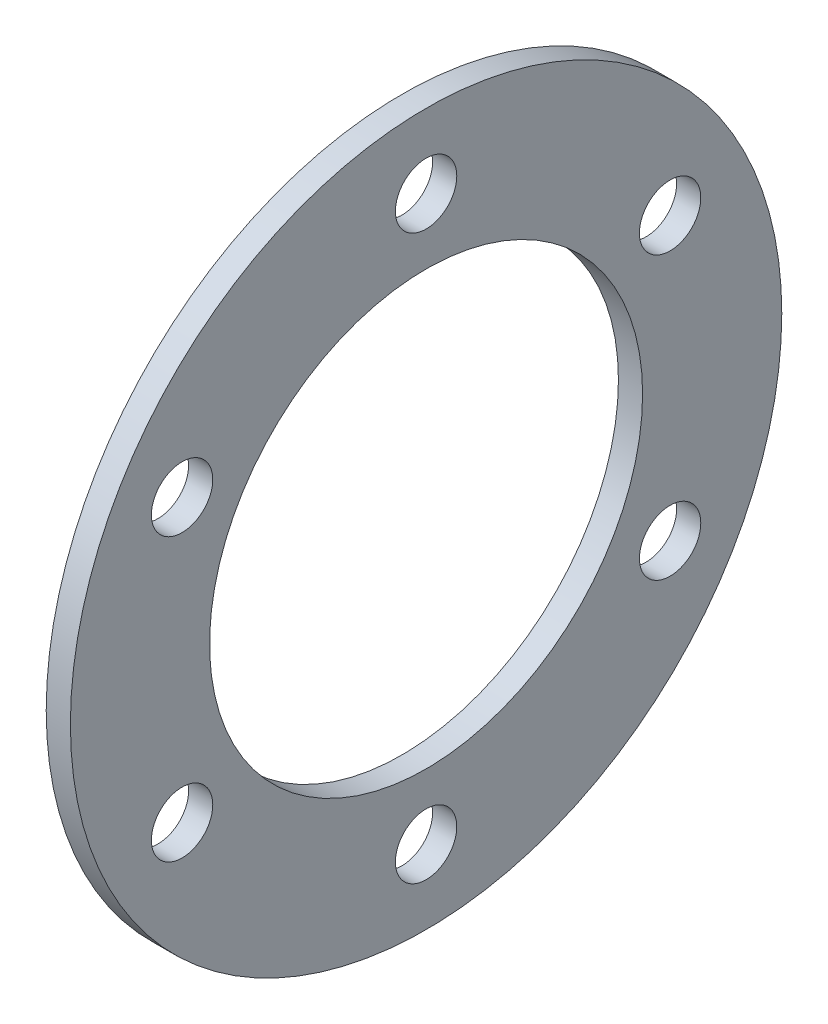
ISO-10303-21;
HEADER;
FILE_DESCRIPTION(('STEP AP214'),'2;1');
FILE_NAME('part.step','',(''),(''),'','','');
FILE_SCHEMA(('AUTOMOTIVE_DESIGN { 1 0 10303 214 1 1 1 1 }'));
ENDSEC;
DATA;
#1=APPLICATION_CONTEXT('core data for automotive mechanical design processes');
#2=APPLICATION_PROTOCOL_DEFINITION('international standard','automotive_design',2000,#1);
#3=PRODUCT_CONTEXT('',#1,'mechanical');
#4=PRODUCT('Part','Part','',(#3));
#5=PRODUCT_RELATED_PRODUCT_CATEGORY('part','',(#4));
#6=PRODUCT_DEFINITION_FORMATION('','',#4);
#7=PRODUCT_DEFINITION_CONTEXT('part definition',#1,'design');
#8=PRODUCT_DEFINITION('design','',#6,#7);
#9=PRODUCT_DEFINITION_SHAPE('','',#8);
#10=(LENGTH_UNIT() NAMED_UNIT(*) SI_UNIT(.MILLI.,.METRE.));
#11=(NAMED_UNIT(*) PLANE_ANGLE_UNIT() SI_UNIT($,.RADIAN.));
#12=(NAMED_UNIT(*) SI_UNIT($,.STERADIAN.) SOLID_ANGLE_UNIT());
#13=UNCERTAINTY_MEASURE_WITH_UNIT(LENGTH_MEASURE(1.E-05),#10,'distance_accuracy_value','');
#14=(GEOMETRIC_REPRESENTATION_CONTEXT(3) GLOBAL_UNCERTAINTY_ASSIGNED_CONTEXT((#13)) GLOBAL_UNIT_ASSIGNED_CONTEXT((#10,
#11,#12)) REPRESENTATION_CONTEXT('',''));
#15=CARTESIAN_POINT('',(0.,0.,0.));
#16=DIRECTION('',(0.,0.,1.));
#17=DIRECTION('',(1.,0.,0.));
#18=AXIS2_PLACEMENT_3D('',#15,#16,#17);
#19=CARTESIAN_POINT('',(3.125,0.,0.));
#20=DIRECTION('',(1.,0.,0.));
#21=DIRECTION('',(0.,0.,-1.));
#22=AXIS2_PLACEMENT_3D('',#19,#20,#21);
#23=PLANE('',#22);
#24=CARTESIAN_POINT('',(3.125,18.2176562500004,31.5539062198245));
#25=DIRECTION('',(1.,0.,0.));
#26=DIRECTION('',(0.,0.866025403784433,-0.50000000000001));
#27=AXIS2_PLACEMENT_3D('',#24,#25,#26);
#28=CIRCLE('',#27,3.96874999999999);
#29=CARTESIAN_POINT('',(3.125,21.6546945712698,29.5695312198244));
#30=VERTEX_POINT('',#29);
#31=EDGE_CURVE('E82',#30,#30,#28,.T.);
#32=ORIENTED_EDGE('',*,*,#31,.F.);
#33=EDGE_LOOP('',(#32));
#34=FACE_BOUND('',#33,.T.);
#35=CARTESIAN_POINT('',(3.125,-18.2176562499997,31.5539062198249));
#36=DIRECTION('',(1.,0.,0.));
#37=DIRECTION('',(0.,0.866025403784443,0.499999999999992));
#38=AXIS2_PLACEMENT_3D('',#35,#36,#37);
#39=CIRCLE('',#38,3.96874999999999);
#40=CARTESIAN_POINT('',(3.125,-14.7806179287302,33.5382812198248));
#41=VERTEX_POINT('',#40);
#42=EDGE_CURVE('E76',#41,#41,#39,.T.);
#43=ORIENTED_EDGE('',*,*,#42,.F.);
#44=EDGE_LOOP('',(#43));
#45=FACE_BOUND('',#44,.T.);
#46=CARTESIAN_POINT('',(3.125,-36.4353125,0.));
#47=DIRECTION('',(1.,0.,0.));
#48=DIRECTION('',(0.,0.,1.));
#49=AXIS2_PLACEMENT_3D('',#46,#47,#48);
#50=CIRCLE('',#49,3.96874999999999);
#51=CARTESIAN_POINT('',(3.125,-36.4353125,3.96874999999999));
#52=VERTEX_POINT('',#51);
#53=EDGE_CURVE('E70',#52,#52,#50,.T.);
#54=ORIENTED_EDGE('',*,*,#53,.F.);
#55=EDGE_LOOP('',(#54));
#56=FACE_BOUND('',#55,.T.);
#57=CARTESIAN_POINT('',(3.125,-18.2176562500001,-31.5539062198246));
#58=DIRECTION('',(1.,0.,0.));
#59=DIRECTION('',(0.,-0.866025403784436,0.500000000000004));
#60=AXIS2_PLACEMENT_3D('',#57,#58,#59);
#61=CIRCLE('',#60,3.96874999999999);
#62=CARTESIAN_POINT('',(3.125,-21.6546945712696,-29.5695312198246));
#63=VERTEX_POINT('',#62);
#64=EDGE_CURVE('E64',#63,#63,#61,.T.);
#65=ORIENTED_EDGE('',*,*,#64,.F.);
#66=EDGE_LOOP('',(#65));
#67=FACE_BOUND('',#66,.T.);
#68=CARTESIAN_POINT('',(3.125,18.2176562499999,-31.5539062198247));
#69=DIRECTION('',(1.,0.,0.));
#70=DIRECTION('',(0.,-0.86602540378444,-0.499999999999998));
#71=AXIS2_PLACEMENT_3D('',#68,#69,#70);
#72=CIRCLE('',#71,3.96874999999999);
#73=CARTESIAN_POINT('',(3.125,14.7806179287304,-33.5382812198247));
#74=VERTEX_POINT('',#73);
#75=EDGE_CURVE('E58',#74,#74,#72,.T.);
#76=ORIENTED_EDGE('',*,*,#75,.F.);
#77=EDGE_LOOP('',(#76));
#78=FACE_BOUND('',#77,.T.);
#79=CARTESIAN_POINT('',(3.125,36.4353125,0.));
#80=DIRECTION('',(1.,0.,0.));
#81=DIRECTION('',(0.,0.,-1.));
#82=AXIS2_PLACEMENT_3D('',#79,#80,#81);
#83=CIRCLE('',#82,3.96874999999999);
#84=CARTESIAN_POINT('',(3.125,36.4353125,-3.96874999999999));
#85=VERTEX_POINT('',#84);
#86=EDGE_CURVE('E52',#85,#85,#83,.T.);
#87=ORIENTED_EDGE('',*,*,#86,.F.);
#88=EDGE_LOOP('',(#87));
#89=FACE_BOUND('',#88,.T.);
#90=CARTESIAN_POINT('',(3.125,0.,0.));
#91=DIRECTION('',(1.,0.,0.));
#92=DIRECTION('',(0.,0.,-1.));
#93=AXIS2_PLACEMENT_3D('',#90,#91,#92);
#94=CIRCLE('',#93,46.);
#95=CARTESIAN_POINT('',(3.125,0.,-46.));
#96=VERTEX_POINT('',#95);
#97=EDGE_CURVE('E10',#96,#96,#94,.T.);
#98=ORIENTED_EDGE('',*,*,#97,.T.);
#99=EDGE_LOOP('',(#98));
#100=FACE_BOUND('',#99,.T.);
#101=CARTESIAN_POINT('',(3.125,0.,0.));
#102=DIRECTION('',(1.,0.,0.));
#103=DIRECTION('',(0.,0.,-1.));
#104=AXIS2_PLACEMENT_3D('',#101,#102,#103);
#105=CIRCLE('',#104,28.);
#106=CARTESIAN_POINT('',(3.125,0.,-28.));
#107=VERTEX_POINT('',#106);
#108=EDGE_CURVE('E44',#107,#107,#105,.T.);
#109=ORIENTED_EDGE('',*,*,#108,.F.);
#110=EDGE_LOOP('',(#109));
#111=FACE_BOUND('',#110,.T.);
#112=ADVANCED_FACE('F33',(#34,#45,#56,#67,#78,#89,#100,#111),#23,.T.);
#113=CARTESIAN_POINT('',(0.,0.,0.));
#114=DIRECTION('',(1.,0.,0.));
#115=DIRECTION('',(0.,0.,-1.));
#116=AXIS2_PLACEMENT_3D('',#113,#114,#115);
#117=PLANE('',#116);
#118=CARTESIAN_POINT('',(0.,18.2176562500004,31.5539062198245));
#119=DIRECTION('',(1.,0.,0.));
#120=DIRECTION('',(0.,0.866025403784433,-0.50000000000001));
#121=AXIS2_PLACEMENT_3D('',#118,#119,#120);
#122=CIRCLE('',#121,3.96874999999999);
#123=CARTESIAN_POINT('',(0.,21.6546945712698,29.5695312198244));
#124=VERTEX_POINT('',#123);
#125=EDGE_CURVE('E79',#124,#124,#122,.T.);
#126=ORIENTED_EDGE('',*,*,#125,.T.);
#127=EDGE_LOOP('',(#126));
#128=FACE_BOUND('',#127,.T.);
#129=CARTESIAN_POINT('',(0.,-18.2176562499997,31.5539062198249));
#130=DIRECTION('',(1.,0.,0.));
#131=DIRECTION('',(0.,0.866025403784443,0.499999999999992));
#132=AXIS2_PLACEMENT_3D('',#129,#130,#131);
#133=CIRCLE('',#132,3.96874999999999);
#134=CARTESIAN_POINT('',(0.,-14.7806179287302,33.5382812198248));
#135=VERTEX_POINT('',#134);
#136=EDGE_CURVE('E73',#135,#135,#133,.T.);
#137=ORIENTED_EDGE('',*,*,#136,.T.);
#138=EDGE_LOOP('',(#137));
#139=FACE_BOUND('',#138,.T.);
#140=CARTESIAN_POINT('',(0.,-36.4353125,0.));
#141=DIRECTION('',(1.,0.,0.));
#142=DIRECTION('',(0.,0.,1.));
#143=AXIS2_PLACEMENT_3D('',#140,#141,#142);
#144=CIRCLE('',#143,3.96874999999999);
#145=CARTESIAN_POINT('',(0.,-36.4353125,3.96874999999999));
#146=VERTEX_POINT('',#145);
#147=EDGE_CURVE('E67',#146,#146,#144,.T.);
#148=ORIENTED_EDGE('',*,*,#147,.T.);
#149=EDGE_LOOP('',(#148));
#150=FACE_BOUND('',#149,.T.);
#151=CARTESIAN_POINT('',(0.,-18.2176562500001,-31.5539062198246));
#152=DIRECTION('',(1.,0.,0.));
#153=DIRECTION('',(0.,-0.866025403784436,0.500000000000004));
#154=AXIS2_PLACEMENT_3D('',#151,#152,#153);
#155=CIRCLE('',#154,3.96874999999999);
#156=CARTESIAN_POINT('',(0.,-21.6546945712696,-29.5695312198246));
#157=VERTEX_POINT('',#156);
#158=EDGE_CURVE('E61',#157,#157,#155,.T.);
#159=ORIENTED_EDGE('',*,*,#158,.T.);
#160=EDGE_LOOP('',(#159));
#161=FACE_BOUND('',#160,.T.);
#162=CARTESIAN_POINT('',(0.,18.2176562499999,-31.5539062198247));
#163=DIRECTION('',(1.,0.,0.));
#164=DIRECTION('',(0.,-0.86602540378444,-0.499999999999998));
#165=AXIS2_PLACEMENT_3D('',#162,#163,#164);
#166=CIRCLE('',#165,3.96874999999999);
#167=CARTESIAN_POINT('',(0.,14.7806179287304,-33.5382812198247));
#168=VERTEX_POINT('',#167);
#169=EDGE_CURVE('E55',#168,#168,#166,.T.);
#170=ORIENTED_EDGE('',*,*,#169,.T.);
#171=EDGE_LOOP('',(#170));
#172=FACE_BOUND('',#171,.T.);
#173=CARTESIAN_POINT('',(0.,36.4353125,0.));
#174=DIRECTION('',(1.,0.,0.));
#175=DIRECTION('',(0.,0.,-1.));
#176=AXIS2_PLACEMENT_3D('',#173,#174,#175);
#177=CIRCLE('',#176,3.96874999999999);
#178=CARTESIAN_POINT('',(0.,36.4353125,-3.96874999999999));
#179=VERTEX_POINT('',#178);
#180=EDGE_CURVE('E49',#179,#179,#177,.T.);
#181=ORIENTED_EDGE('',*,*,#180,.T.);
#182=EDGE_LOOP('',(#181));
#183=FACE_BOUND('',#182,.T.);
#184=CARTESIAN_POINT('',(0.,0.,0.));
#185=DIRECTION('',(1.,0.,0.));
#186=DIRECTION('',(0.,0.,-1.));
#187=AXIS2_PLACEMENT_3D('',#184,#185,#186);
#188=CIRCLE('',#187,46.);
#189=CARTESIAN_POINT('',(0.,0.,-46.));
#190=VERTEX_POINT('',#189);
#191=EDGE_CURVE('E37',#190,#190,#188,.T.);
#192=ORIENTED_EDGE('',*,*,#191,.F.);
#193=EDGE_LOOP('',(#192));
#194=FACE_BOUND('',#193,.T.);
#195=CARTESIAN_POINT('',(0.,0.,0.));
#196=DIRECTION('',(1.,0.,0.));
#197=DIRECTION('',(0.,0.,-1.));
#198=AXIS2_PLACEMENT_3D('',#195,#196,#197);
#199=CIRCLE('',#198,28.);
#200=CARTESIAN_POINT('',(0.,0.,-28.));
#201=VERTEX_POINT('',#200);
#202=EDGE_CURVE('E46',#201,#201,#199,.T.);
#203=ORIENTED_EDGE('',*,*,#202,.T.);
#204=EDGE_LOOP('',(#203));
#205=FACE_BOUND('',#204,.T.);
#206=ADVANCED_FACE('F88',(#128,#139,#150,#161,#172,#183,#194,#205),#117,.F.);
#207=CARTESIAN_POINT('',(3.125,0.,0.));
#208=DIRECTION('',(-1.,0.,0.));
#209=DIRECTION('',(0.,0.,1.));
#210=AXIS2_PLACEMENT_3D('',#207,#208,#209);
#211=CYLINDRICAL_SURFACE('',#210,46.);
#212=ORIENTED_EDGE('',*,*,#97,.F.);
#213=EDGE_LOOP('',(#212));
#214=FACE_BOUND('',#213,.T.);
#215=ORIENTED_EDGE('',*,*,#191,.T.);
#216=EDGE_LOOP('',(#215));
#217=FACE_BOUND('',#216,.T.);
#218=ADVANCED_FACE('F35',(#214,#217),#211,.T.);
#219=CARTESIAN_POINT('',(3.125,0.,0.));
#220=DIRECTION('',(-1.,0.,0.));
#221=DIRECTION('',(0.,0.,1.));
#222=AXIS2_PLACEMENT_3D('',#219,#220,#221);
#223=CYLINDRICAL_SURFACE('',#222,28.);
#224=ORIENTED_EDGE('',*,*,#108,.T.);
#225=EDGE_LOOP('',(#224));
#226=FACE_BOUND('',#225,.T.);
#227=ORIENTED_EDGE('',*,*,#202,.F.);
#228=EDGE_LOOP('',(#227));
#229=FACE_BOUND('',#228,.T.);
#230=ADVANCED_FACE('F113',(#226,#229),#223,.F.);
#231=CARTESIAN_POINT('',(0.,36.4353125,0.));
#232=DIRECTION('',(1.,0.,0.));
#233=DIRECTION('',(0.,0.,-1.));
#234=AXIS2_PLACEMENT_3D('',#231,#232,#233);
#235=CYLINDRICAL_SURFACE('',#234,3.96874999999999);
#236=ORIENTED_EDGE('',*,*,#180,.F.);
#237=EDGE_LOOP('',(#236));
#238=FACE_BOUND('',#237,.T.);
#239=ORIENTED_EDGE('',*,*,#86,.T.);
#240=EDGE_LOOP('',(#239));
#241=FACE_BOUND('',#240,.T.);
#242=ADVANCED_FACE('F116',(#238,#241),#235,.F.);
#243=CARTESIAN_POINT('',(0.,18.2176562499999,-31.5539062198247));
#244=DIRECTION('',(1.,0.,0.));
#245=DIRECTION('',(0.,0.,-1.));
#246=AXIS2_PLACEMENT_3D('',#243,#244,#245);
#247=CYLINDRICAL_SURFACE('',#246,3.96874999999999);
#248=ORIENTED_EDGE('',*,*,#169,.F.);
#249=EDGE_LOOP('',(#248));
#250=FACE_BOUND('',#249,.T.);
#251=ORIENTED_EDGE('',*,*,#75,.T.);
#252=EDGE_LOOP('',(#251));
#253=FACE_BOUND('',#252,.T.);
#254=ADVANCED_FACE('F128',(#250,#253),#247,.F.);
#255=CARTESIAN_POINT('',(0.,-18.2176562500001,-31.5539062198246));
#256=DIRECTION('',(1.,0.,0.));
#257=DIRECTION('',(0.,0.,-1.));
#258=AXIS2_PLACEMENT_3D('',#255,#256,#257);
#259=CYLINDRICAL_SURFACE('',#258,3.96874999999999);
#260=ORIENTED_EDGE('',*,*,#158,.F.);
#261=EDGE_LOOP('',(#260));
#262=FACE_BOUND('',#261,.T.);
#263=ORIENTED_EDGE('',*,*,#64,.T.);
#264=EDGE_LOOP('',(#263));
#265=FACE_BOUND('',#264,.T.);
#266=ADVANCED_FACE('F132',(#262,#265),#259,.F.);
#267=CARTESIAN_POINT('',(0.,-36.4353125,0.));
#268=DIRECTION('',(1.,0.,0.));
#269=DIRECTION('',(0.,0.,-1.));
#270=AXIS2_PLACEMENT_3D('',#267,#268,#269);
#271=CYLINDRICAL_SURFACE('',#270,3.96874999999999);
#272=ORIENTED_EDGE('',*,*,#147,.F.);
#273=EDGE_LOOP('',(#272));
#274=FACE_BOUND('',#273,.T.);
#275=ORIENTED_EDGE('',*,*,#53,.T.);
#276=EDGE_LOOP('',(#275));
#277=FACE_BOUND('',#276,.T.);
#278=ADVANCED_FACE('F136',(#274,#277),#271,.F.);
#279=CARTESIAN_POINT('',(0.,-18.2176562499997,31.5539062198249));
#280=DIRECTION('',(1.,0.,0.));
#281=DIRECTION('',(0.,0.,-1.));
#282=AXIS2_PLACEMENT_3D('',#279,#280,#281);
#283=CYLINDRICAL_SURFACE('',#282,3.96874999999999);
#284=ORIENTED_EDGE('',*,*,#136,.F.);
#285=EDGE_LOOP('',(#284));
#286=FACE_BOUND('',#285,.T.);
#287=ORIENTED_EDGE('',*,*,#42,.T.);
#288=EDGE_LOOP('',(#287));
#289=FACE_BOUND('',#288,.T.);
#290=ADVANCED_FACE('F94',(#286,#289),#283,.F.);
#291=CARTESIAN_POINT('',(0.,18.2176562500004,31.5539062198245));
#292=DIRECTION('',(1.,0.,0.));
#293=DIRECTION('',(0.,0.,-1.));
#294=AXIS2_PLACEMENT_3D('',#291,#292,#293);
#295=CYLINDRICAL_SURFACE('',#294,3.96874999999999);
#296=ORIENTED_EDGE('',*,*,#125,.F.);
#297=EDGE_LOOP('',(#296));
#298=FACE_BOUND('',#297,.T.);
#299=ORIENTED_EDGE('',*,*,#31,.T.);
#300=EDGE_LOOP('',(#299));
#301=FACE_BOUND('',#300,.T.);
#302=ADVANCED_FACE('F91',(#298,#301),#295,.F.);
#303=CLOSED_SHELL('',(#112,#206,#218,#230,#242,#254,#266,#278,#290,#302));
#304=MANIFOLD_SOLID_BREP('B2',#303);
#305=ADVANCED_BREP_SHAPE_REPRESENTATION('',(#18,#304),#14);
#306=SHAPE_DEFINITION_REPRESENTATION(#9,#305);
ENDSEC;
END-ISO-10303-21;
